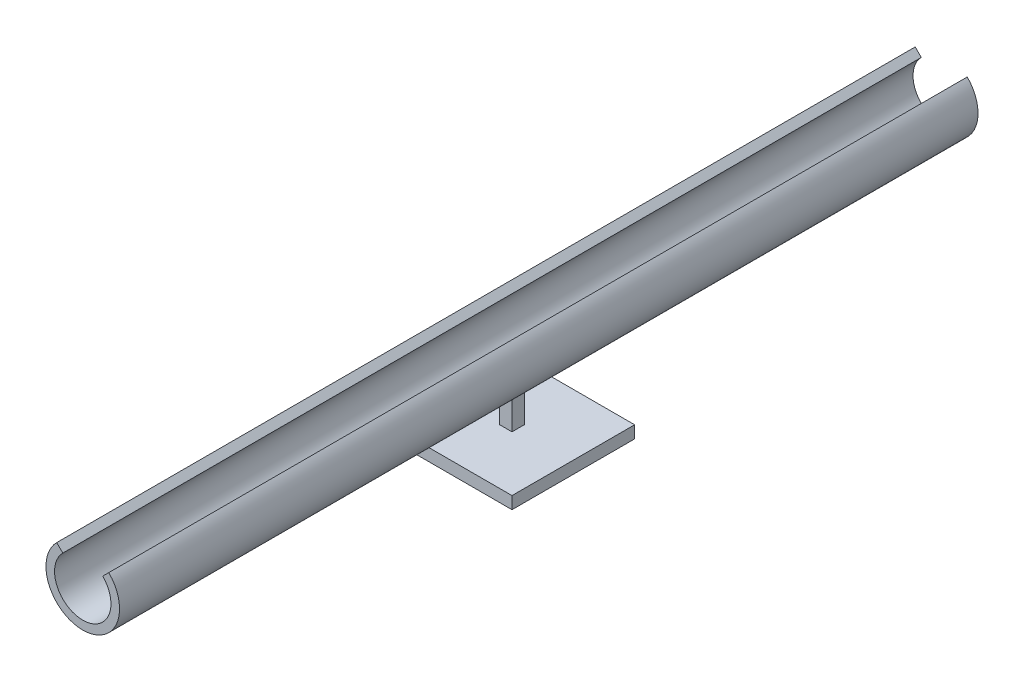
from build123d import *

# Parameters (mm, degrees)
BOSS_EXTRU_1_DEPTH = 350
ESQUISSE2_W        = 10
ESQUISSE2_H        = 30.419601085
BOSS_EXTRU_2_DEPTH = 5
ESQUISSE3_W        = 100
ESQUISSE3_H        = 10
BOSS_EXTRU_3_DEPTH = 50


with BuildPart() as part:
    # Esquisse1 → Boss.-Extru.1 (new, symmetric)
    with BuildSketch(Plane.XY):
        with BuildLine():
            Line((16.263455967, 16.263455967), (21.213203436, 21.213203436))
            ThreePointArc((21.213203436, 21.213203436), (0, -30), (-21.213203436, 21.213203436))
            Line((-21.213203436, 21.213203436), (-16.263455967, 16.263455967))
            ThreePointArc((-16.263455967, 16.263455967), (0, -23), (16.263455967, 16.263455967))
        make_face()
    extrude(amount=BOSS_EXTRU_1_DEPTH, both=True)

    # Esquisse2 → Boss.-Extru.2 (add, symmetric)
    with BuildSketch(Plane.XY):
        with Locations((0, -44.790199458)):
            Rectangle(ESQUISSE2_W, ESQUISSE2_H)
    extrude(amount=BOSS_EXTRU_2_DEPTH, both=True)

    # Esquisse3 → Boss.-Extru.3 (add, symmetric)
    with BuildSketch(Plane.XY):
        with Locations((0, -65)):
            Rectangle(ESQUISSE3_W, ESQUISSE3_H)
    extrude(amount=BOSS_EXTRU_3_DEPTH, both=True)


solid = part.part
